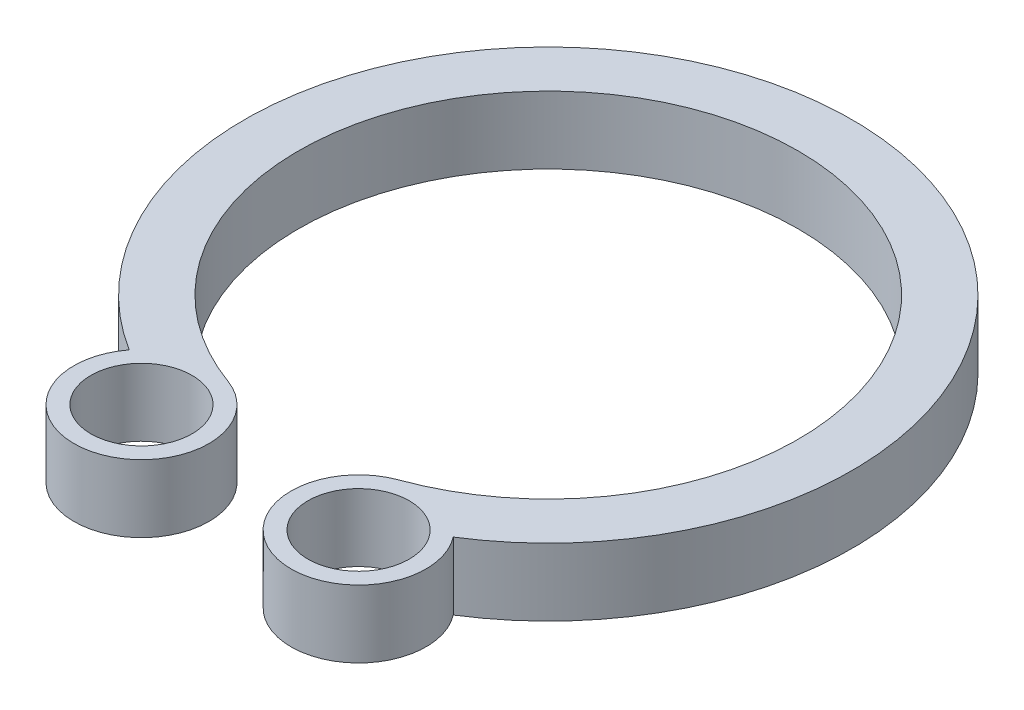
from build123d import *

# Parameters (mm, degrees)
SKETCH_1_R      = 0.75
EXTRUDE_1_DEPTH = 1


with BuildPart() as part:
    # Sketch 1 → Extrude 1 (new body)
    with BuildSketch(Plane(origin=(0, 0, 0), x_dir=(1, 0, 0), z_dir=(0, 1, 0))):
        with BuildLine():
            ThreePointArc((2.399939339, -3.806611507), (0, 4.5), (-2.399939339, -3.806611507))
            ThreePointArc((-2.399939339, -3.806611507), (-1.328381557, -5.376813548), (-1.26547453, -3.476862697))
            ThreePointArc((-1.26547453, -3.476862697), (0, 3.7), (1.26547453, -3.476862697))
            ThreePointArc((1.26547453, -3.476862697), (1.328381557, -5.376813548), (2.399939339, -3.806611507))
        make_face()
        with Locations(Location((-1.607494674, -4.416555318, 0), (0, 0, 270))):
            Circle(SKETCH_1_R, mode=Mode.SUBTRACT)
        with Locations(Location((1.607494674, -4.416555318, 0), (0, 0, 90))):
            Circle(SKETCH_1_R, mode=Mode.SUBTRACT)
    extrude(amount=EXTRUDE_1_DEPTH)


solid = part.part
